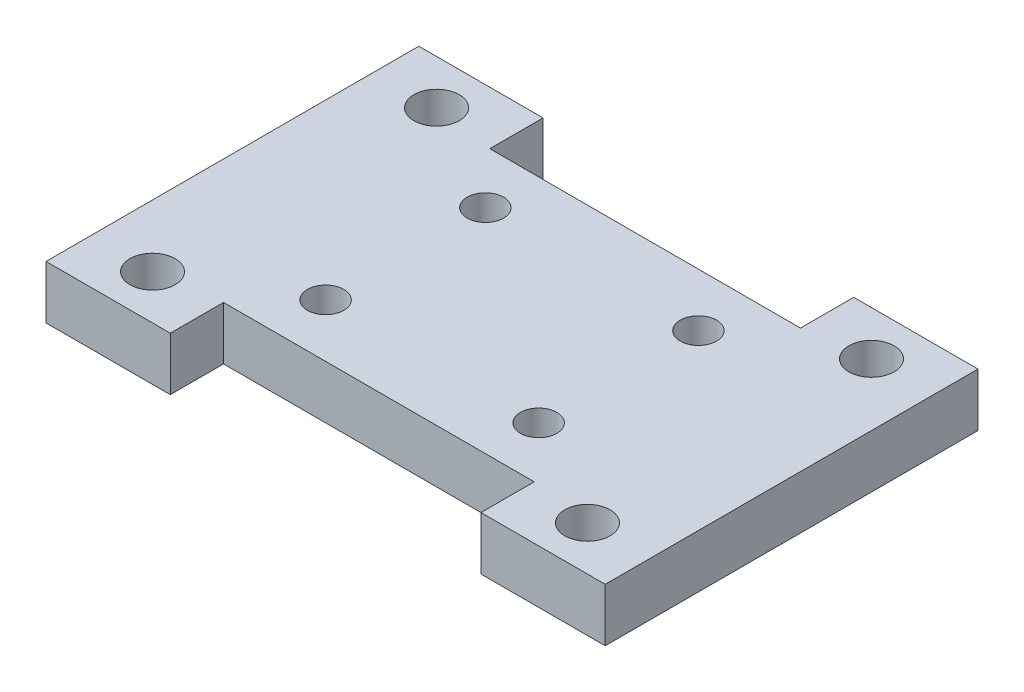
from build123d import *

# Parameters (mm, degrees)
SKETCH1_R           = 2.05
SKETCH1_R_2         = 2.55
BOSS_EXTRUDE1_DEPTH = 6


with BuildPart() as part:
    # Sketch1 → Boss-Extrude1 (new body)
    with BuildSketch(Plane(origin=(0, 0, 0), x_dir=(1, 0, 0), z_dir=(0, 1, 0))):
        Polygon((-17.5, -15), (17.5, -15), (17.5, -21), (31.5, -21), (31.5, 21), (17.5, 21), (17.5, 15), (-17.5, 15), (-17.5, 21), (-31.5, 21), (-31.5, -21), (-17.5, -21), align=None)
        with Locations(Location((-12, 9, 0), (0, 0, 270))):
            Circle(SKETCH1_R, mode=Mode.SUBTRACT)
        with Locations(Location((12, 9, 0), (0, 0, 90))):
            Circle(SKETCH1_R, mode=Mode.SUBTRACT)
        with Locations(Location((12, -9, 0), (0, 0, 270))):
            Circle(SKETCH1_R, mode=Mode.SUBTRACT)
        with Locations(Location((-12, -9, 0), (0, 0, 90))):
            Circle(SKETCH1_R, mode=Mode.SUBTRACT)
        with Locations(Location((24.5, 16, 0), (0, 0, 270))):
            Circle(SKETCH1_R_2, mode=Mode.SUBTRACT)
        with Locations(Location((24.5, -16, 0), (0, 0, 90))):
            Circle(SKETCH1_R_2, mode=Mode.SUBTRACT)
        with Locations(Location((-24.5, -16, 0), (0, 0, 270))):
            Circle(SKETCH1_R_2, mode=Mode.SUBTRACT)
        with Locations(Location((-24.5, 16, 0), (0, 0, 90))):
            Circle(SKETCH1_R_2, mode=Mode.SUBTRACT)
    extrude(amount=BOSS_EXTRUDE1_DEPTH)


solid = part.part
